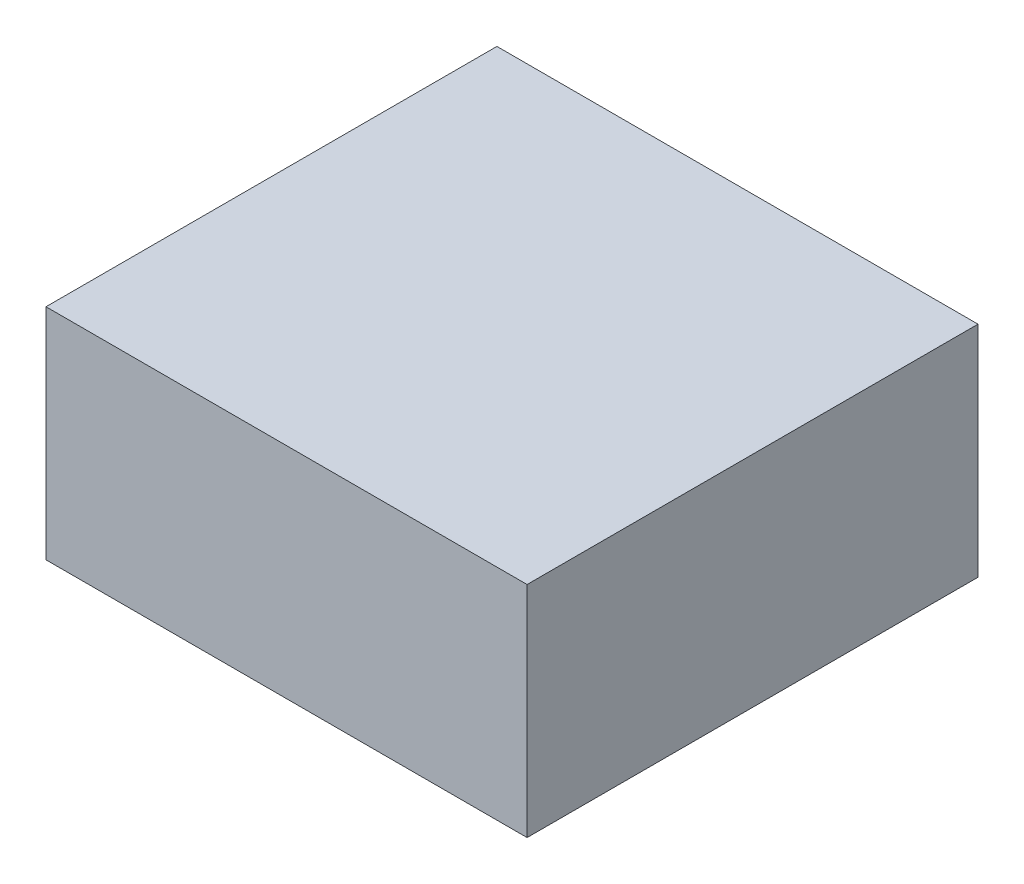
ISO-10303-21;
HEADER;
FILE_DESCRIPTION(('STEP AP214'),'2;1');
FILE_NAME('part.step','',(''),(''),'','','');
FILE_SCHEMA(('AUTOMOTIVE_DESIGN { 1 0 10303 214 1 1 1 1 }'));
ENDSEC;
DATA;
#1=APPLICATION_CONTEXT('core data for automotive mechanical design processes');
#2=APPLICATION_PROTOCOL_DEFINITION('international standard','automotive_design',2000,#1);
#3=PRODUCT_CONTEXT('',#1,'mechanical');
#4=PRODUCT('Part','Part','',(#3));
#5=PRODUCT_RELATED_PRODUCT_CATEGORY('part','',(#4));
#6=PRODUCT_DEFINITION_FORMATION('','',#4);
#7=PRODUCT_DEFINITION_CONTEXT('part definition',#1,'design');
#8=PRODUCT_DEFINITION('design','',#6,#7);
#9=PRODUCT_DEFINITION_SHAPE('','',#8);
#10=(LENGTH_UNIT() NAMED_UNIT(*) SI_UNIT(.MILLI.,.METRE.));
#11=(NAMED_UNIT(*) PLANE_ANGLE_UNIT() SI_UNIT($,.RADIAN.));
#12=(NAMED_UNIT(*) SI_UNIT($,.STERADIAN.) SOLID_ANGLE_UNIT());
#13=UNCERTAINTY_MEASURE_WITH_UNIT(LENGTH_MEASURE(1.E-05),#10,'distance_accuracy_value','');
#14=(GEOMETRIC_REPRESENTATION_CONTEXT(3) GLOBAL_UNCERTAINTY_ASSIGNED_CONTEXT((#13)) GLOBAL_UNIT_ASSIGNED_CONTEXT((#10,
#11,#12)) REPRESENTATION_CONTEXT('',''));
#15=CARTESIAN_POINT('',(0.,0.,0.));
#16=DIRECTION('',(0.,0.,1.));
#17=DIRECTION('',(1.,0.,0.));
#18=AXIS2_PLACEMENT_3D('',#15,#16,#17);
#19=CARTESIAN_POINT('',(28.6004808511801,8.5,24.7751409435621));
#20=DIRECTION('',(-1.,0.,0.));
#21=DIRECTION('',(0.,0.,1.));
#22=AXIS2_PLACEMENT_3D('',#19,#20,#21);
#23=PLANE('',#22);
#24=DIRECTION('',(0.,-1.,0.));
#25=VECTOR('',#24,1.);
#26=CARTESIAN_POINT('',(28.6004808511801,8.5,24.7751409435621));
#27=LINE('',#26,#25);
#28=CARTESIAN_POINT('',(28.6004808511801,8.5,24.7751409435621));
#29=VERTEX_POINT('',#28);
#30=CARTESIAN_POINT('',(28.6004808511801,-16.6,24.7751409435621));
#31=VERTEX_POINT('',#30);
#32=EDGE_CURVE('E9627',#29,#31,#27,.T.);
#33=ORIENTED_EDGE('',*,*,#32,.T.);
#34=DIRECTION('',(0.,0.,-1.));
#35=VECTOR('',#34,1.);
#36=CARTESIAN_POINT('',(28.6004808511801,-16.6,24.7751409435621));
#37=LINE('',#36,#35);
#38=CARTESIAN_POINT('',(28.6004808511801,-16.6,-26.8613124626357));
#39=VERTEX_POINT('',#38);
#40=EDGE_CURVE('E9622',#31,#39,#37,.T.);
#41=ORIENTED_EDGE('',*,*,#40,.T.);
#42=DIRECTION('',(0.,-1.,0.));
#43=VECTOR('',#42,1.);
#44=CARTESIAN_POINT('',(28.6004808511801,8.5,-26.8613124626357));
#45=LINE('',#44,#43);
#46=CARTESIAN_POINT('',(28.6004808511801,8.5,-26.8613124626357));
#47=VERTEX_POINT('',#46);
#48=EDGE_CURVE('E13',#47,#39,#45,.T.);
#49=ORIENTED_EDGE('',*,*,#48,.F.);
#50=DIRECTION('',(0.,0.,-1.));
#51=VECTOR('',#50,1.);
#52=CARTESIAN_POINT('',(28.6004808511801,8.5,24.7751409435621));
#53=LINE('',#52,#51);
#54=EDGE_CURVE('E9633',#29,#47,#53,.T.);
#55=ORIENTED_EDGE('',*,*,#54,.F.);
#56=EDGE_LOOP('',(#33,#41,#49,#55));
#57=FACE_BOUND('',#56,.T.);
#58=ADVANCED_FACE('F9570',(#57),#23,.F.);
#59=CARTESIAN_POINT('',(28.6004808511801,8.5,-26.8613124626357));
#60=DIRECTION('',(0.,0.,1.));
#61=DIRECTION('',(1.,0.,0.));
#62=AXIS2_PLACEMENT_3D('',#59,#60,#61);
#63=PLANE('',#62);
#64=ORIENTED_EDGE('',*,*,#48,.T.);
#65=DIRECTION('',(-1.,0.,0.));
#66=VECTOR('',#65,1.);
#67=CARTESIAN_POINT('',(28.6004808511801,-16.6,-26.8613124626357));
#68=LINE('',#67,#66);
#69=CARTESIAN_POINT('',(-26.4916940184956,-16.6,-26.8613124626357));
#70=VERTEX_POINT('',#69);
#71=EDGE_CURVE('E9612',#39,#70,#68,.T.);
#72=ORIENTED_EDGE('',*,*,#71,.T.);
#73=DIRECTION('',(0.,-1.,0.));
#74=VECTOR('',#73,1.);
#75=CARTESIAN_POINT('',(-26.4916940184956,8.5,-26.8613124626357));
#76=LINE('',#75,#74);
#77=CARTESIAN_POINT('',(-26.4916940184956,8.5,-26.8613124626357));
#78=VERTEX_POINT('',#77);
#79=EDGE_CURVE('E9577',#78,#70,#76,.T.);
#80=ORIENTED_EDGE('',*,*,#79,.F.);
#81=DIRECTION('',(-1.,0.,0.));
#82=VECTOR('',#81,1.);
#83=CARTESIAN_POINT('',(28.6004808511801,8.5,-26.8613124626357));
#84=LINE('',#83,#82);
#85=EDGE_CURVE('E9613',#47,#78,#84,.T.);
#86=ORIENTED_EDGE('',*,*,#85,.F.);
#87=EDGE_LOOP('',(#64,#72,#80,#86));
#88=FACE_BOUND('',#87,.T.);
#89=ADVANCED_FACE('F9610',(#88),#63,.F.);
#90=CARTESIAN_POINT('',(-26.4916940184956,8.5,24.7751409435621));
#91=DIRECTION('',(1.,0.,0.));
#92=DIRECTION('',(0.,0.,-1.));
#93=AXIS2_PLACEMENT_3D('',#90,#91,#92);
#94=PLANE('',#93);
#95=ORIENTED_EDGE('',*,*,#79,.T.);
#96=DIRECTION('',(0.,0.,1.));
#97=VECTOR('',#96,1.);
#98=CARTESIAN_POINT('',(-26.4916940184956,-16.6,24.7751409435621));
#99=LINE('',#98,#97);
#100=CARTESIAN_POINT('',(-26.4916940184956,-16.6,24.7751409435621));
#101=VERTEX_POINT('',#100);
#102=EDGE_CURVE('E9625',#70,#101,#99,.T.);
#103=ORIENTED_EDGE('',*,*,#102,.T.);
#104=DIRECTION('',(0.,-1.,0.));
#105=VECTOR('',#104,1.);
#106=CARTESIAN_POINT('',(-26.4916940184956,8.5,24.7751409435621));
#107=LINE('',#106,#105);
#108=CARTESIAN_POINT('',(-26.4916940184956,8.5,24.7751409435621));
#109=VERTEX_POINT('',#108);
#110=EDGE_CURVE('E9639',#109,#101,#107,.T.);
#111=ORIENTED_EDGE('',*,*,#110,.F.);
#112=DIRECTION('',(0.,0.,1.));
#113=VECTOR('',#112,1.);
#114=CARTESIAN_POINT('',(-26.4916940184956,8.5,24.7751409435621));
#115=LINE('',#114,#113);
#116=EDGE_CURVE('E9589',#78,#109,#115,.T.);
#117=ORIENTED_EDGE('',*,*,#116,.F.);
#118=EDGE_LOOP('',(#95,#103,#111,#117));
#119=FACE_BOUND('',#118,.T.);
#120=ADVANCED_FACE('F9641',(#119),#94,.F.);
#121=CARTESIAN_POINT('',(28.6004808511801,8.5,24.7751409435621));
#122=DIRECTION('',(0.,0.,-1.));
#123=DIRECTION('',(-1.,0.,0.));
#124=AXIS2_PLACEMENT_3D('',#121,#122,#123);
#125=PLANE('',#124);
#126=ORIENTED_EDGE('',*,*,#110,.T.);
#127=DIRECTION('',(1.,0.,0.));
#128=VECTOR('',#127,1.);
#129=CARTESIAN_POINT('',(28.6004808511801,-16.6,24.7751409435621));
#130=LINE('',#129,#128);
#131=EDGE_CURVE('E9631',#101,#31,#130,.T.);
#132=ORIENTED_EDGE('',*,*,#131,.T.);
#133=ORIENTED_EDGE('',*,*,#32,.F.);
#134=DIRECTION('',(1.,0.,0.));
#135=VECTOR('',#134,1.);
#136=CARTESIAN_POINT('',(28.6004808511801,8.5,24.7751409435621));
#137=LINE('',#136,#135);
#138=EDGE_CURVE('E9584',#109,#29,#137,.T.);
#139=ORIENTED_EDGE('',*,*,#138,.F.);
#140=EDGE_LOOP('',(#126,#132,#133,#139));
#141=FACE_BOUND('',#140,.T.);
#142=ADVANCED_FACE('F9643',(#141),#125,.F.);
#143=CARTESIAN_POINT('',(28.6004808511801,8.5,-26.8613124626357));
#144=DIRECTION('',(0.,1.,0.));
#145=DIRECTION('',(0.,0.,1.));
#146=AXIS2_PLACEMENT_3D('',#143,#144,#145);
#147=PLANE('',#146);
#148=ORIENTED_EDGE('',*,*,#54,.T.);
#149=ORIENTED_EDGE('',*,*,#85,.T.);
#150=ORIENTED_EDGE('',*,*,#116,.T.);
#151=ORIENTED_EDGE('',*,*,#138,.T.);
#152=EDGE_LOOP('',(#148,#149,#150,#151));
#153=FACE_BOUND('',#152,.T.);
#154=ADVANCED_FACE('F9644',(#153),#147,.T.);
#155=CARTESIAN_POINT('',(28.6004808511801,-16.6,-26.8613124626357));
#156=DIRECTION('',(0.,1.,0.));
#157=DIRECTION('',(0.,0.,1.));
#158=AXIS2_PLACEMENT_3D('',#155,#156,#157);
#159=PLANE('',#158);
#160=ORIENTED_EDGE('',*,*,#40,.F.);
#161=ORIENTED_EDGE('',*,*,#131,.F.);
#162=ORIENTED_EDGE('',*,*,#102,.F.);
#163=ORIENTED_EDGE('',*,*,#71,.F.);
#164=EDGE_LOOP('',(#160,#161,#162,#163));
#165=FACE_BOUND('',#164,.T.);
#166=ADVANCED_FACE('F9620',(#165),#159,.F.);
#167=CLOSED_SHELL('',(#58,#89,#120,#142,#154,#166));
#168=MANIFOLD_SOLID_BREP('B2',#167);
#169=ADVANCED_BREP_SHAPE_REPRESENTATION('',(#18,#168),#14);
#170=SHAPE_DEFINITION_REPRESENTATION(#9,#169);
ENDSEC;
END-ISO-10303-21;
